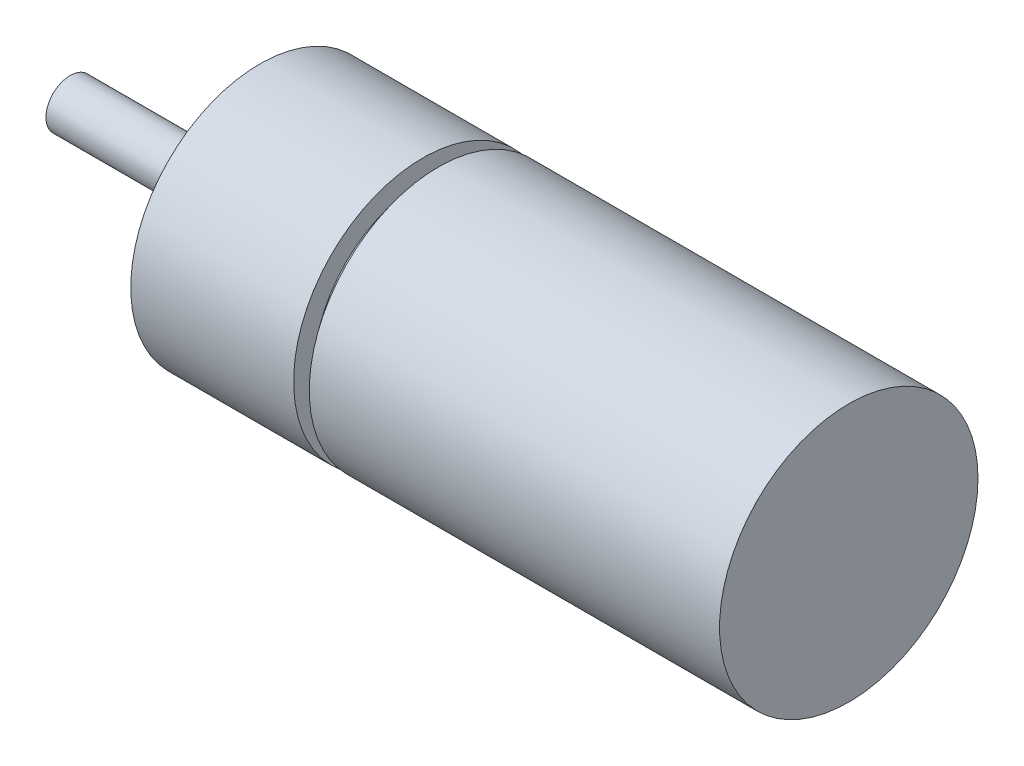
from build123d import *

# Parameters (mm, degrees)
M2X0_4_TAPPED_HOLE1_D     = 1.6
M2X0_4_TAPPED_HOLE1_DEPTH = 5.334
M2X0_4_TAPPED_HOLE1_TIP   = 0.480688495


with BuildPart() as part:
    # Sketch2 → Revolve1 (revolve)
    with BuildSketch(Plane.XY, mode=Mode.PRIVATE) as revolve1_sk:
        Polygon((0, 0), (0, 8), (-25.4, 8), (-25.4, 7), (-26.367430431, 6.746862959), (-26.367430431, 8), (-36.45, 8), (-36.45, 3), (-38.45, 3), (-38.45, 1.5), (-48.2, 1.5), (-48.2, 0), align=None)
    revolve(revolve1_sk.sketch.rotate(Axis((0, 0, 0), (-1, 0, 0)), 90), axis=Axis((0, 0, 0), (-1, 0, 0)))

    # M2x0.4 Tapped Hole1
    with Locations(Plane.ZY.offset(36.45)):
        with Locations((0, 5), (0, -5)):
            Hole(M2X0_4_TAPPED_HOLE1_D / 2, depth=M2X0_4_TAPPED_HOLE1_DEPTH)
            with Locations((0, 0, -(M2X0_4_TAPPED_HOLE1_DEPTH + M2X0_4_TAPPED_HOLE1_TIP / 2))):  # 118° drill point
                Cone(0, M2X0_4_TAPPED_HOLE1_D / 2, M2X0_4_TAPPED_HOLE1_TIP, mode=Mode.SUBTRACT)


solid = part.part
